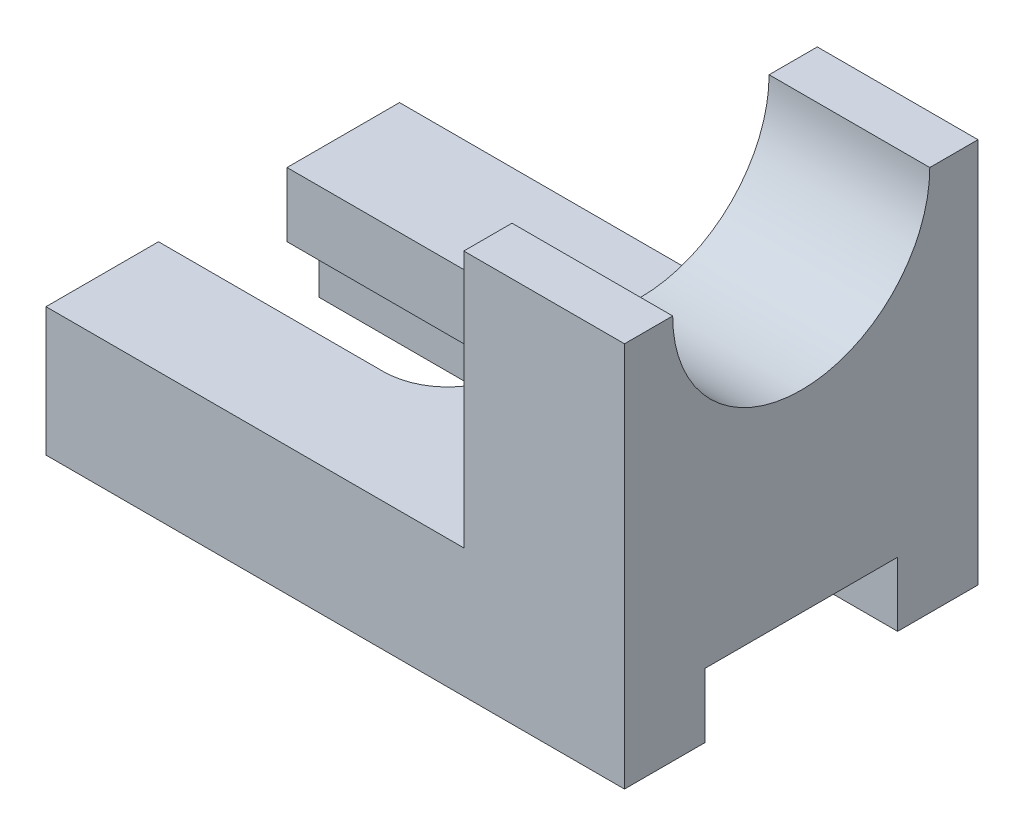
from build123d import *

# Parameters (mm, degrees)
EXTRUDE_1_DEPTH     = 20
SKETCH_2_W          = 25
SKETCH_2_H          = 55
EXTRUDE_2_DEPTH     = 40
SKETCH_3_R          = 20
SKETCH_3_W          = 30
SKETCH_3_H          = 10
CUT_EXTRUDE_1_DEPTH = 122.346610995


with BuildPart() as part:
    # Sketch 1 → Extrude 1 (new body)
    with BuildSketch(Plane(origin=(0, 0, 0), x_dir=(1, 0, 0), z_dir=(0, 1, 0))):
        with BuildLine():
            Line((0, 0), (90, 0))
            Line((90, 0), (90, 55))
            Line((90, 55), (0, 55))
            Line((0, 55), (0, 37.5))
            Line((0, 37.5), (35, 37.5))
            ThreePointArc((35, 37.5), (45, 27.5), (35, 17.5))
            Line((35, 17.5), (0, 17.5))
            Line((0, 17.5), (0, 0))
        make_face()
    extrude(amount=EXTRUDE_1_DEPTH)

    # Sketch 2 → Extrude 2 (add)
    with BuildSketch(Plane(origin=(0, 20, 0), x_dir=(1, 0, 0), z_dir=(0, 1, 0))):
        with Locations((77.5, 27.5)):
            Rectangle(SKETCH_2_W, SKETCH_2_H)
    extrude(amount=EXTRUDE_2_DEPTH)

    # Sketch 3 → Cut-Extrude 1 (cut, through all)
    with BuildSketch(Plane(origin=(90, 0, 0), x_dir=(0, 0, -1), z_dir=(1, 0, 0))):
        with Locations((27.5, 60)):
            Circle(SKETCH_3_R)
        with Locations((27.5, 5)):
            Rectangle(SKETCH_3_W, SKETCH_3_H)
    extrude(amount=-CUT_EXTRUDE_1_DEPTH, mode=Mode.SUBTRACT)


solid = part.part
